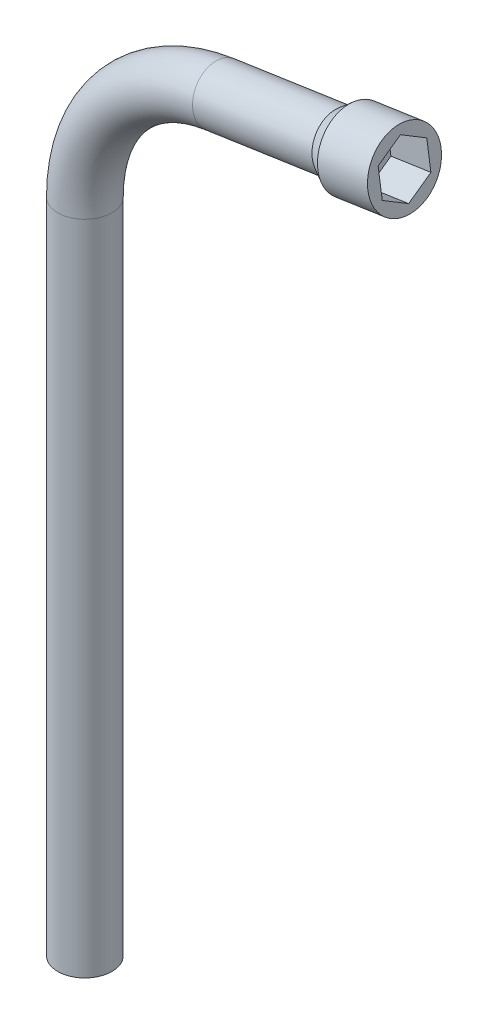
from build123d import *

# Parameters (mm, degrees)
SKETCH8_R          = 9.525
CUT_EXTRUDE3_DEPTH = 14.186860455


with BuildPart() as part:
    # Sweep2: sweep along a path in Sketch1
    with BuildLine(Plane.XY) as sweep2_path:
        Line((0, 0), (0, 230.598043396))
        ThreePointArc((0, 230.598043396), (13.487376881, 266.891358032), (47.403028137, 285.568687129))
        Line((47.403028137, 285.568687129), (89.325762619, 291.800724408))
    # Sketch8 → Sweep2 (sweep)
    with BuildSketch(Plane(origin=(89.325762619, 291.800724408, 0), x_dir=(0, 0, -1), z_dir=(0.9891306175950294, 0.1470395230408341, 0))):
        Circle(SKETCH8_R)
    sweep(path=sweep2_path.line)

    # Sketch6 → Revolve2 (revolve)
    with BuildSketch(Plane.XY):
        Polygon((87.925211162, 301.222193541), (89.325762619, 291.800724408), (112.183151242, 295.198596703), (110.293263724, 307.911815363), (92.735827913, 305.301809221), align=None)
    revolve(axis=Axis((89.325762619, 291.800724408, 0), (0.9891306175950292, 0.14703952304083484, 0)))

    # Sketch9 → Cut-Extrude3 (cut)
    with BuildSketch(Plane(origin=(152.69174777, 22.698439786, 0), x_dir=(0, 0, -1), z_dir=(0.9891306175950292, 0.14703952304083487, 0))):
        Polygon((0, 285.3505492), (-8.535490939, 280.422581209), (-8.535490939, 270.566645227), (0, 265.638677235), (8.535490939, 270.566645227), (8.535490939, 280.422581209), align=None)
    extrude(amount=-CUT_EXTRUDE3_DEPTH, mode=Mode.SUBTRACT)


solid = part.part
